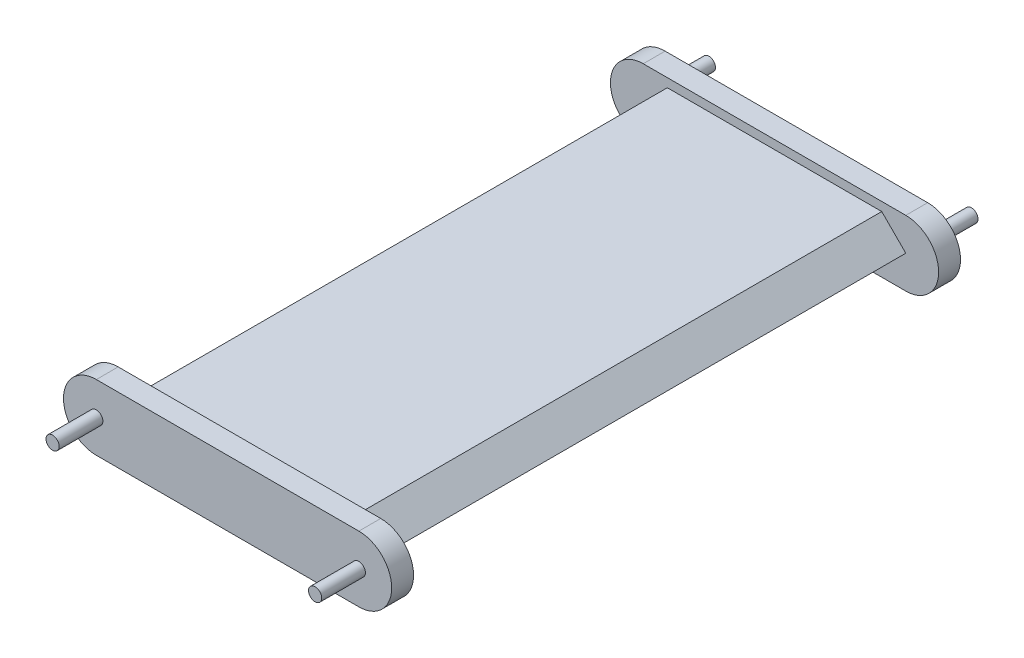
ISO-10303-21;
HEADER;
FILE_DESCRIPTION(('STEP AP214'),'2;1');
FILE_NAME('part.step','',(''),(''),'','','');
FILE_SCHEMA(('AUTOMOTIVE_DESIGN { 1 0 10303 214 1 1 1 1 }'));
ENDSEC;
DATA;
#1=APPLICATION_CONTEXT('core data for automotive mechanical design processes');
#2=APPLICATION_PROTOCOL_DEFINITION('international standard','automotive_design',2000,#1);
#3=PRODUCT_CONTEXT('',#1,'mechanical');
#4=PRODUCT('Part','Part','',(#3));
#5=PRODUCT_RELATED_PRODUCT_CATEGORY('part','',(#4));
#6=PRODUCT_DEFINITION_FORMATION('','',#4);
#7=PRODUCT_DEFINITION_CONTEXT('part definition',#1,'design');
#8=PRODUCT_DEFINITION('design','',#6,#7);
#9=PRODUCT_DEFINITION_SHAPE('','',#8);
#10=(LENGTH_UNIT() NAMED_UNIT(*) SI_UNIT(.MILLI.,.METRE.));
#11=(NAMED_UNIT(*) PLANE_ANGLE_UNIT() SI_UNIT($,.RADIAN.));
#12=(NAMED_UNIT(*) SI_UNIT($,.STERADIAN.) SOLID_ANGLE_UNIT());
#13=UNCERTAINTY_MEASURE_WITH_UNIT(LENGTH_MEASURE(1.E-05),#10,'distance_accuracy_value','');
#14=(GEOMETRIC_REPRESENTATION_CONTEXT(3) GLOBAL_UNCERTAINTY_ASSIGNED_CONTEXT((#13)) GLOBAL_UNIT_ASSIGNED_CONTEXT((#10,
#11,#12)) REPRESENTATION_CONTEXT('',''));
#15=CARTESIAN_POINT('',(0.,0.,0.));
#16=DIRECTION('',(0.,0.,1.));
#17=DIRECTION('',(1.,0.,0.));
#18=AXIS2_PLACEMENT_3D('',#15,#16,#17);
#19=CARTESIAN_POINT('',(76.2,0.,-317.5));
#20=DIRECTION('',(0.,0.,1.));
#21=DIRECTION('',(1.,0.,0.));
#22=AXIS2_PLACEMENT_3D('',#19,#20,#21);
#23=PLANE('',#22);
#24=CARTESIAN_POINT('',(-76.2,0.,-317.5));
#25=DIRECTION('',(0.,0.,1.));
#26=DIRECTION('',(1.,0.,0.));
#27=AXIS2_PLACEMENT_3D('',#24,#25,#26);
#28=CIRCLE('',#27,3.81000000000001);
#29=CARTESIAN_POINT('',(-72.39,0.,-317.5));
#30=VERTEX_POINT('',#29);
#31=EDGE_CURVE('E219',#30,#30,#28,.F.);
#32=ORIENTED_EDGE('',*,*,#31,.F.);
#33=EDGE_LOOP('',(#32));
#34=FACE_BOUND('',#33,.T.);
#35=CARTESIAN_POINT('',(76.2,0.,-317.5));
#36=DIRECTION('',(0.,0.,-1.));
#37=DIRECTION('',(1.,0.,0.));
#38=AXIS2_PLACEMENT_3D('',#35,#36,#37);
#39=CIRCLE('',#38,19.05);
#40=CARTESIAN_POINT('',(76.2,19.05,-317.5));
#41=VERTEX_POINT('',#40);
#42=CARTESIAN_POINT('',(76.2,-19.05,-317.5));
#43=VERTEX_POINT('',#42);
#44=EDGE_CURVE('E147',#41,#43,#39,.T.);
#45=ORIENTED_EDGE('',*,*,#44,.T.);
#46=DIRECTION('',(-1.,0.,0.));
#47=VECTOR('',#46,1.);
#48=CARTESIAN_POINT('',(76.2,-19.05,-317.5));
#49=LINE('',#48,#47);
#50=CARTESIAN_POINT('',(-76.2,-19.05,-317.5));
#51=VERTEX_POINT('',#50);
#52=EDGE_CURVE('E136',#43,#51,#49,.T.);
#53=ORIENTED_EDGE('',*,*,#52,.T.);
#54=CARTESIAN_POINT('',(-76.2,0.,-317.5));
#55=DIRECTION('',(0.,0.,-1.));
#56=DIRECTION('',(1.,0.,0.));
#57=AXIS2_PLACEMENT_3D('',#54,#55,#56);
#58=CIRCLE('',#57,19.05);
#59=CARTESIAN_POINT('',(-76.2,19.05,-317.5));
#60=VERTEX_POINT('',#59);
#61=EDGE_CURVE('E146',#51,#60,#58,.T.);
#62=ORIENTED_EDGE('',*,*,#61,.T.);
#63=DIRECTION('',(1.,0.,0.));
#64=VECTOR('',#63,1.);
#65=CARTESIAN_POINT('',(76.2,19.05,-317.5));
#66=LINE('',#65,#64);
#67=EDGE_CURVE('E152',#60,#41,#66,.T.);
#68=ORIENTED_EDGE('',*,*,#67,.T.);
#69=EDGE_LOOP('',(#45,#53,#62,#68));
#70=FACE_BOUND('',#69,.T.);
#71=CARTESIAN_POINT('',(76.2,0.,-317.5));
#72=DIRECTION('',(0.,0.,1.));
#73=DIRECTION('',(1.,0.,0.));
#74=AXIS2_PLACEMENT_3D('',#71,#72,#73);
#75=CIRCLE('',#74,3.81);
#76=CARTESIAN_POINT('',(80.01,0.,-317.5));
#77=VERTEX_POINT('',#76);
#78=EDGE_CURVE('E222',#77,#77,#75,.F.);
#79=ORIENTED_EDGE('',*,*,#78,.F.);
#80=EDGE_LOOP('',(#79));
#81=FACE_BOUND('',#80,.T.);
#82=ADVANCED_FACE('F34',(#34,#70,#81),#23,.F.);
#83=CARTESIAN_POINT('',(-76.2,0.,0.));
#84=DIRECTION('',(0.,0.,-1.));
#85=DIRECTION('',(-1.,0.,0.));
#86=AXIS2_PLACEMENT_3D('',#83,#84,#85);
#87=PLANE('',#86);
#88=CARTESIAN_POINT('',(-76.2,0.,0.));
#89=DIRECTION('',(0.,0.,1.));
#90=DIRECTION('',(-1.,0.,0.));
#91=AXIS2_PLACEMENT_3D('',#88,#89,#90);
#92=CIRCLE('',#91,19.05);
#93=CARTESIAN_POINT('',(-76.2,19.05,0.));
#94=VERTEX_POINT('',#93);
#95=CARTESIAN_POINT('',(-76.2,-19.05,0.));
#96=VERTEX_POINT('',#95);
#97=EDGE_CURVE('E183',#94,#96,#92,.T.);
#98=ORIENTED_EDGE('',*,*,#97,.F.);
#99=DIRECTION('',(-1.,0.,0.));
#100=VECTOR('',#99,1.);
#101=CARTESIAN_POINT('',(-76.2,19.05,0.));
#102=LINE('',#101,#100);
#103=CARTESIAN_POINT('',(76.2,19.05,0.));
#104=VERTEX_POINT('',#103);
#105=EDGE_CURVE('E188',#104,#94,#102,.T.);
#106=ORIENTED_EDGE('',*,*,#105,.F.);
#107=CARTESIAN_POINT('',(76.2,0.,0.));
#108=DIRECTION('',(0.,0.,1.));
#109=DIRECTION('',(-1.,0.,0.));
#110=AXIS2_PLACEMENT_3D('',#107,#108,#109);
#111=CIRCLE('',#110,19.05);
#112=CARTESIAN_POINT('',(76.2,-19.05,0.));
#113=VERTEX_POINT('',#112);
#114=EDGE_CURVE('E199',#113,#104,#111,.T.);
#115=ORIENTED_EDGE('',*,*,#114,.F.);
#116=DIRECTION('',(1.,0.,0.));
#117=VECTOR('',#116,1.);
#118=CARTESIAN_POINT('',(-76.2,-19.05,0.));
#119=LINE('',#118,#117);
#120=EDGE_CURVE('E197',#96,#113,#119,.T.);
#121=ORIENTED_EDGE('',*,*,#120,.F.);
#122=EDGE_LOOP('',(#98,#106,#115,#121));
#123=FACE_BOUND('',#122,.T.);
#124=DIRECTION('',(0.707106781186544,0.707106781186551,0.));
#125=VECTOR('',#124,1.);
#126=CARTESIAN_POINT('',(-62.2299999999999,13.97,0.));
#127=LINE('',#126,#125);
#128=CARTESIAN_POINT('',(-62.2299999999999,13.97,0.));
#129=VERTEX_POINT('',#128);
#130=CARTESIAN_POINT('',(-76.2,-2.5832923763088E-13,0.));
#131=VERTEX_POINT('',#130);
#132=EDGE_CURVE('E57',#129,#131,#127,.F.);
#133=ORIENTED_EDGE('',*,*,#132,.T.);
#134=DIRECTION('',(-0.707106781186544,0.707106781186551,0.));
#135=VECTOR('',#134,1.);
#136=CARTESIAN_POINT('',(-76.2,2.1163626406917E-13,0.));
#137=LINE('',#136,#135);
#138=CARTESIAN_POINT('',(-62.2299999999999,-13.97,0.));
#139=VERTEX_POINT('',#138);
#140=EDGE_CURVE('E43',#131,#139,#137,.F.);
#141=ORIENTED_EDGE('',*,*,#140,.T.);
#142=DIRECTION('',(-1.,0.,0.));
#143=VECTOR('',#142,1.);
#144=CARTESIAN_POINT('',(-76.2,-13.97,0.));
#145=LINE('',#144,#143);
#146=CARTESIAN_POINT('',(62.2299999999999,-13.9700000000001,0.));
#147=VERTEX_POINT('',#146);
#148=EDGE_CURVE('E164',#147,#139,#145,.T.);
#149=ORIENTED_EDGE('',*,*,#148,.F.);
#150=DIRECTION('',(-0.707106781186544,-0.707106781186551,0.));
#151=VECTOR('',#150,1.);
#152=CARTESIAN_POINT('',(62.2299999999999,-13.9700000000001,0.));
#153=LINE('',#152,#151);
#154=CARTESIAN_POINT('',(76.2,-2.70616862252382E-13,0.));
#155=VERTEX_POINT('',#154);
#156=EDGE_CURVE('E239',#147,#155,#153,.F.);
#157=ORIENTED_EDGE('',*,*,#156,.T.);
#158=DIRECTION('',(0.707106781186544,-0.707106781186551,0.));
#159=VECTOR('',#158,1.);
#160=CARTESIAN_POINT('',(76.2,-2.70616862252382E-13,0.));
#161=LINE('',#160,#159);
#162=CARTESIAN_POINT('',(62.2299999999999,13.97,0.));
#163=VERTEX_POINT('',#162);
#164=EDGE_CURVE('E235',#155,#163,#161,.F.);
#165=ORIENTED_EDGE('',*,*,#164,.T.);
#166=DIRECTION('',(1.,0.,0.));
#167=VECTOR('',#166,1.);
#168=CARTESIAN_POINT('',(-76.2,13.97,0.));
#169=LINE('',#168,#167);
#170=EDGE_CURVE('E161',#129,#163,#169,.T.);
#171=ORIENTED_EDGE('',*,*,#170,.F.);
#172=EDGE_LOOP('',(#133,#141,#149,#157,#165,#171));
#173=FACE_BOUND('',#172,.T.);
#174=ADVANCED_FACE('F263',(#123,#173),#87,.T.);
#175=CARTESIAN_POINT('',(-76.2,0.,12.7));
#176=DIRECTION('',(0.,0.,-1.));
#177=DIRECTION('',(-1.,0.,0.));
#178=AXIS2_PLACEMENT_3D('',#175,#176,#177);
#179=PLANE('',#178);
#180=CARTESIAN_POINT('',(76.2,0.,12.7));
#181=DIRECTION('',(0.,0.,-1.));
#182=DIRECTION('',(-1.,0.,0.));
#183=AXIS2_PLACEMENT_3D('',#180,#181,#182);
#184=CIRCLE('',#183,3.81);
#185=CARTESIAN_POINT('',(72.39,0.,12.7));
#186=VERTEX_POINT('',#185);
#187=EDGE_CURVE('E213',#186,#186,#184,.F.);
#188=ORIENTED_EDGE('',*,*,#187,.F.);
#189=EDGE_LOOP('',(#188));
#190=FACE_BOUND('',#189,.T.);
#191=CARTESIAN_POINT('',(-76.2,0.,12.7));
#192=DIRECTION('',(0.,0.,1.));
#193=DIRECTION('',(-1.,0.,0.));
#194=AXIS2_PLACEMENT_3D('',#191,#192,#193);
#195=CIRCLE('',#194,19.05);
#196=CARTESIAN_POINT('',(-76.2,19.05,12.7));
#197=VERTEX_POINT('',#196);
#198=CARTESIAN_POINT('',(-76.2,-19.05,12.7));
#199=VERTEX_POINT('',#198);
#200=EDGE_CURVE('E184',#197,#199,#195,.T.);
#201=ORIENTED_EDGE('',*,*,#200,.T.);
#202=DIRECTION('',(1.,0.,0.));
#203=VECTOR('',#202,1.);
#204=CARTESIAN_POINT('',(-76.2,-19.05,12.7));
#205=LINE('',#204,#203);
#206=CARTESIAN_POINT('',(76.2,-19.05,12.7));
#207=VERTEX_POINT('',#206);
#208=EDGE_CURVE('E187',#199,#207,#205,.T.);
#209=ORIENTED_EDGE('',*,*,#208,.T.);
#210=CARTESIAN_POINT('',(76.2,0.,12.7));
#211=DIRECTION('',(0.,0.,1.));
#212=DIRECTION('',(-1.,0.,0.));
#213=AXIS2_PLACEMENT_3D('',#210,#211,#212);
#214=CIRCLE('',#213,19.05);
#215=CARTESIAN_POINT('',(76.2,19.05,12.7));
#216=VERTEX_POINT('',#215);
#217=EDGE_CURVE('E190',#207,#216,#214,.T.);
#218=ORIENTED_EDGE('',*,*,#217,.T.);
#219=DIRECTION('',(-1.,0.,0.));
#220=VECTOR('',#219,1.);
#221=CARTESIAN_POINT('',(-76.2,19.05,12.7));
#222=LINE('',#221,#220);
#223=EDGE_CURVE('E192',#216,#197,#222,.T.);
#224=ORIENTED_EDGE('',*,*,#223,.T.);
#225=EDGE_LOOP('',(#201,#209,#218,#224));
#226=FACE_BOUND('',#225,.T.);
#227=CARTESIAN_POINT('',(-76.2,0.,12.7));
#228=DIRECTION('',(0.,0.,-1.));
#229=DIRECTION('',(-1.,0.,0.));
#230=AXIS2_PLACEMENT_3D('',#227,#228,#229);
#231=CIRCLE('',#230,3.81);
#232=CARTESIAN_POINT('',(-80.01,0.,12.7));
#233=VERTEX_POINT('',#232);
#234=EDGE_CURVE('E216',#233,#233,#231,.F.);
#235=ORIENTED_EDGE('',*,*,#234,.F.);
#236=EDGE_LOOP('',(#235));
#237=FACE_BOUND('',#236,.T.);
#238=ADVANCED_FACE('F294',(#190,#226,#237),#179,.F.);
#239=CARTESIAN_POINT('',(-76.2,0.,12.7));
#240=DIRECTION('',(0.,0.,-1.));
#241=DIRECTION('',(-1.,0.,0.));
#242=AXIS2_PLACEMENT_3D('',#239,#240,#241);
#243=CYLINDRICAL_SURFACE('',#242,19.05);
#244=ORIENTED_EDGE('',*,*,#97,.T.);
#245=DIRECTION('',(0.,0.,-1.));
#246=VECTOR('',#245,1.);
#247=CARTESIAN_POINT('',(-76.2,-19.05,12.7));
#248=LINE('',#247,#246);
#249=EDGE_CURVE('E210',#199,#96,#248,.T.);
#250=ORIENTED_EDGE('',*,*,#249,.F.);
#251=ORIENTED_EDGE('',*,*,#200,.F.);
#252=DIRECTION('',(0.,0.,-1.));
#253=VECTOR('',#252,1.);
#254=CARTESIAN_POINT('',(-76.2,19.05,12.7));
#255=LINE('',#254,#253);
#256=EDGE_CURVE('E194',#197,#94,#255,.T.);
#257=ORIENTED_EDGE('',*,*,#256,.T.);
#258=EDGE_LOOP('',(#244,#250,#251,#257));
#259=FACE_BOUND('',#258,.T.);
#260=ADVANCED_FACE('F474',(#259),#243,.T.);
#261=CARTESIAN_POINT('',(-76.2,-19.05,12.7));
#262=DIRECTION('',(0.,1.,0.));
#263=DIRECTION('',(-1.,0.,0.));
#264=AXIS2_PLACEMENT_3D('',#261,#262,#263);
#265=PLANE('',#264);
#266=ORIENTED_EDGE('',*,*,#120,.T.);
#267=DIRECTION('',(0.,0.,-1.));
#268=VECTOR('',#267,1.);
#269=CARTESIAN_POINT('',(76.2,-19.05,12.7));
#270=LINE('',#269,#268);
#271=EDGE_CURVE('E207',#207,#113,#270,.T.);
#272=ORIENTED_EDGE('',*,*,#271,.F.);
#273=ORIENTED_EDGE('',*,*,#208,.F.);
#274=ORIENTED_EDGE('',*,*,#249,.T.);
#275=EDGE_LOOP('',(#266,#272,#273,#274));
#276=FACE_BOUND('',#275,.T.);
#277=ADVANCED_FACE('F494',(#276),#265,.F.);
#278=CARTESIAN_POINT('',(76.2,0.,12.7));
#279=DIRECTION('',(0.,0.,-1.));
#280=DIRECTION('',(-1.,0.,0.));
#281=AXIS2_PLACEMENT_3D('',#278,#279,#280);
#282=CYLINDRICAL_SURFACE('',#281,19.05);
#283=ORIENTED_EDGE('',*,*,#114,.T.);
#284=DIRECTION('',(0.,0.,-1.));
#285=VECTOR('',#284,1.);
#286=CARTESIAN_POINT('',(76.2,19.05,12.7));
#287=LINE('',#286,#285);
#288=EDGE_CURVE('E204',#216,#104,#287,.T.);
#289=ORIENTED_EDGE('',*,*,#288,.F.);
#290=ORIENTED_EDGE('',*,*,#217,.F.);
#291=ORIENTED_EDGE('',*,*,#271,.T.);
#292=EDGE_LOOP('',(#283,#289,#290,#291));
#293=FACE_BOUND('',#292,.T.);
#294=ADVANCED_FACE('F484',(#293),#282,.T.);
#295=CARTESIAN_POINT('',(-76.2,19.05,12.7));
#296=DIRECTION('',(0.,-1.,0.));
#297=DIRECTION('',(0.,0.,-1.));
#298=AXIS2_PLACEMENT_3D('',#295,#296,#297);
#299=PLANE('',#298);
#300=ORIENTED_EDGE('',*,*,#105,.T.);
#301=ORIENTED_EDGE('',*,*,#256,.F.);
#302=ORIENTED_EDGE('',*,*,#223,.F.);
#303=ORIENTED_EDGE('',*,*,#288,.T.);
#304=EDGE_LOOP('',(#300,#301,#302,#303));
#305=FACE_BOUND('',#304,.T.);
#306=ADVANCED_FACE('F464',(#305),#299,.F.);
#307=CARTESIAN_POINT('',(76.2,0.,38.1));
#308=DIRECTION('',(0.,0.,-1.));
#309=DIRECTION('',(-1.,0.,0.));
#310=AXIS2_PLACEMENT_3D('',#307,#308,#309);
#311=CYLINDRICAL_SURFACE('',#310,3.81);
#312=CARTESIAN_POINT('',(76.2,0.,38.1));
#313=DIRECTION('',(0.,0.,1.));
#314=DIRECTION('',(1.,0.,0.));
#315=AXIS2_PLACEMENT_3D('',#312,#313,#314);
#316=CIRCLE('',#315,3.81);
#317=CARTESIAN_POINT('',(80.01,0.,38.1));
#318=VERTEX_POINT('',#317);
#319=EDGE_CURVE('E180',#318,#318,#316,.T.);
#320=ORIENTED_EDGE('',*,*,#319,.F.);
#321=EDGE_LOOP('',(#320));
#322=FACE_BOUND('',#321,.T.);
#323=ORIENTED_EDGE('',*,*,#187,.T.);
#324=EDGE_LOOP('',(#323));
#325=FACE_BOUND('',#324,.T.);
#326=ADVANCED_FACE('F454',(#322,#325),#311,.T.);
#327=CARTESIAN_POINT('',(76.2,0.,38.1));
#328=DIRECTION('',(0.,0.,1.));
#329=DIRECTION('',(1.,0.,0.));
#330=AXIS2_PLACEMENT_3D('',#327,#328,#329);
#331=PLANE('',#330);
#332=ORIENTED_EDGE('',*,*,#319,.T.);
#333=EDGE_LOOP('',(#332));
#334=FACE_BOUND('',#333,.T.);
#335=ADVANCED_FACE('F444',(#334),#331,.T.);
#336=CARTESIAN_POINT('',(-76.2,0.,38.1));
#337=DIRECTION('',(0.,0.,-1.));
#338=DIRECTION('',(-1.,0.,0.));
#339=AXIS2_PLACEMENT_3D('',#336,#337,#338);
#340=CYLINDRICAL_SURFACE('',#339,3.81);
#341=CARTESIAN_POINT('',(-76.2,0.,38.1));
#342=DIRECTION('',(0.,0.,1.));
#343=DIRECTION('',(1.,0.,0.));
#344=AXIS2_PLACEMENT_3D('',#341,#342,#343);
#345=CIRCLE('',#344,3.81);
#346=CARTESIAN_POINT('',(-72.39,0.,38.1));
#347=VERTEX_POINT('',#346);
#348=EDGE_CURVE('E174',#347,#347,#345,.T.);
#349=ORIENTED_EDGE('',*,*,#348,.F.);
#350=EDGE_LOOP('',(#349));
#351=FACE_BOUND('',#350,.T.);
#352=ORIENTED_EDGE('',*,*,#234,.T.);
#353=EDGE_LOOP('',(#352));
#354=FACE_BOUND('',#353,.T.);
#355=ADVANCED_FACE('F434',(#351,#354),#340,.T.);
#356=CARTESIAN_POINT('',(-76.2,0.,38.1));
#357=DIRECTION('',(0.,0.,1.));
#358=DIRECTION('',(1.,0.,0.));
#359=AXIS2_PLACEMENT_3D('',#356,#357,#358);
#360=PLANE('',#359);
#361=ORIENTED_EDGE('',*,*,#348,.T.);
#362=EDGE_LOOP('',(#361));
#363=FACE_BOUND('',#362,.T.);
#364=ADVANCED_FACE('F362',(#363),#360,.T.);
#365=CARTESIAN_POINT('',(-76.2,13.97,-304.8));
#366=DIRECTION('',(0.,-1.,0.));
#367=DIRECTION('',(1.,0.,0.));
#368=AXIS2_PLACEMENT_3D('',#365,#366,#367);
#369=PLANE('',#368);
#370=ORIENTED_EDGE('',*,*,#170,.T.);
#371=DIRECTION('',(0.,0.,-1.));
#372=VECTOR('',#371,1.);
#373=CARTESIAN_POINT('',(62.2299999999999,13.97,-304.8));
#374=LINE('',#373,#372);
#375=CARTESIAN_POINT('',(62.2299999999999,13.97,-304.8));
#376=VERTEX_POINT('',#375);
#377=EDGE_CURVE('E228',#163,#376,#374,.T.);
#378=ORIENTED_EDGE('',*,*,#377,.T.);
#379=DIRECTION('',(1.,0.,0.));
#380=VECTOR('',#379,1.);
#381=CARTESIAN_POINT('',(-76.2,13.97,-304.8));
#382=LINE('',#381,#380);
#383=CARTESIAN_POINT('',(-62.2299999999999,13.97,-304.8));
#384=VERTEX_POINT('',#383);
#385=EDGE_CURVE('E170',#384,#376,#382,.T.);
#386=ORIENTED_EDGE('',*,*,#385,.F.);
#387=DIRECTION('',(0.,0.,1.));
#388=VECTOR('',#387,1.);
#389=CARTESIAN_POINT('',(-62.2299999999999,13.97,-304.8));
#390=LINE('',#389,#388);
#391=EDGE_CURVE('E225',#384,#129,#390,.T.);
#392=ORIENTED_EDGE('',*,*,#391,.T.);
#393=EDGE_LOOP('',(#370,#378,#386,#392));
#394=FACE_BOUND('',#393,.T.);
#395=ADVANCED_FACE('F274',(#394),#369,.F.);
#396=CARTESIAN_POINT('',(-76.2,-13.97,-304.8));
#397=DIRECTION('',(0.,1.,0.));
#398=DIRECTION('',(-1.,0.,0.));
#399=AXIS2_PLACEMENT_3D('',#396,#397,#398);
#400=PLANE('',#399);
#401=DIRECTION('',(-1.,0.,0.));
#402=VECTOR('',#401,1.);
#403=CARTESIAN_POINT('',(-76.2,-13.97,-304.8));
#404=LINE('',#403,#402);
#405=CARTESIAN_POINT('',(62.2299999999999,-13.9700000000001,-304.8));
#406=VERTEX_POINT('',#405);
#407=CARTESIAN_POINT('',(-62.2299999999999,-13.97,-304.8));
#408=VERTEX_POINT('',#407);
#409=EDGE_CURVE('E173',#406,#408,#404,.T.);
#410=ORIENTED_EDGE('',*,*,#409,.F.);
#411=DIRECTION('',(0.,0.,1.));
#412=VECTOR('',#411,1.);
#413=CARTESIAN_POINT('',(62.2299999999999,-13.9700000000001,-304.8));
#414=LINE('',#413,#412);
#415=EDGE_CURVE('E233',#406,#147,#414,.T.);
#416=ORIENTED_EDGE('',*,*,#415,.T.);
#417=ORIENTED_EDGE('',*,*,#148,.T.);
#418=DIRECTION('',(0.,0.,-1.));
#419=VECTOR('',#418,1.);
#420=CARTESIAN_POINT('',(-62.2299999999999,-13.97,-304.8));
#421=LINE('',#420,#419);
#422=EDGE_CURVE('E231',#139,#408,#421,.T.);
#423=ORIENTED_EDGE('',*,*,#422,.T.);
#424=EDGE_LOOP('',(#410,#416,#417,#423));
#425=FACE_BOUND('',#424,.T.);
#426=ADVANCED_FACE('F267',(#425),#400,.F.);
#427=CARTESIAN_POINT('',(76.2,0.,-304.8));
#428=DIRECTION('',(0.,0.,1.));
#429=DIRECTION('',(1.,0.,0.));
#430=AXIS2_PLACEMENT_3D('',#427,#428,#429);
#431=PLANE('',#430);
#432=CARTESIAN_POINT('',(76.2,0.,-304.8));
#433=DIRECTION('',(0.,0.,-1.));
#434=DIRECTION('',(1.,0.,0.));
#435=AXIS2_PLACEMENT_3D('',#432,#433,#434);
#436=CIRCLE('',#435,19.05);
#437=CARTESIAN_POINT('',(76.2,19.05,-304.8));
#438=VERTEX_POINT('',#437);
#439=CARTESIAN_POINT('',(76.2,-19.05,-304.8));
#440=VERTEX_POINT('',#439);
#441=EDGE_CURVE('E160',#438,#440,#436,.T.);
#442=ORIENTED_EDGE('',*,*,#441,.F.);
#443=DIRECTION('',(1.,0.,0.));
#444=VECTOR('',#443,1.);
#445=CARTESIAN_POINT('',(76.2,19.05,-304.8));
#446=LINE('',#445,#444);
#447=CARTESIAN_POINT('',(-76.2,19.05,-304.8));
#448=VERTEX_POINT('',#447);
#449=EDGE_CURVE('E156',#448,#438,#446,.T.);
#450=ORIENTED_EDGE('',*,*,#449,.F.);
#451=CARTESIAN_POINT('',(-76.2,0.,-304.8));
#452=DIRECTION('',(0.,0.,-1.));
#453=DIRECTION('',(1.,0.,0.));
#454=AXIS2_PLACEMENT_3D('',#451,#452,#453);
#455=CIRCLE('',#454,19.05);
#456=CARTESIAN_POINT('',(-76.2,-19.05,-304.8));
#457=VERTEX_POINT('',#456);
#458=EDGE_CURVE('E535',#457,#448,#455,.T.);
#459=ORIENTED_EDGE('',*,*,#458,.F.);
#460=DIRECTION('',(-1.,0.,0.));
#461=VECTOR('',#460,1.);
#462=CARTESIAN_POINT('',(76.2,-19.05,-304.8));
#463=LINE('',#462,#461);
#464=EDGE_CURVE('E538',#440,#457,#463,.T.);
#465=ORIENTED_EDGE('',*,*,#464,.F.);
#466=EDGE_LOOP('',(#442,#450,#459,#465));
#467=FACE_BOUND('',#466,.T.);
#468=ORIENTED_EDGE('',*,*,#409,.T.);
#469=DIRECTION('',(0.707106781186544,-0.707106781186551,0.));
#470=VECTOR('',#469,1.);
#471=CARTESIAN_POINT('',(-76.2,2.1163626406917E-13,-304.8));
#472=LINE('',#471,#470);
#473=CARTESIAN_POINT('',(-76.2,-2.5832923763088E-13,-304.8));
#474=VERTEX_POINT('',#473);
#475=EDGE_CURVE('E11',#408,#474,#472,.F.);
#476=ORIENTED_EDGE('',*,*,#475,.T.);
#477=DIRECTION('',(-0.707106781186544,-0.707106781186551,0.));
#478=VECTOR('',#477,1.);
#479=CARTESIAN_POINT('',(-62.2299999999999,13.97,-304.8));
#480=LINE('',#479,#478);
#481=EDGE_CURVE('E244',#474,#384,#480,.F.);
#482=ORIENTED_EDGE('',*,*,#481,.T.);
#483=ORIENTED_EDGE('',*,*,#385,.T.);
#484=DIRECTION('',(-0.707106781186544,0.707106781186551,0.));
#485=VECTOR('',#484,1.);
#486=CARTESIAN_POINT('',(76.2,-2.70616862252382E-13,-304.8));
#487=LINE('',#486,#485);
#488=CARTESIAN_POINT('',(76.2,-2.70616862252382E-13,-304.8));
#489=VERTEX_POINT('',#488);
#490=EDGE_CURVE('E237',#376,#489,#487,.F.);
#491=ORIENTED_EDGE('',*,*,#490,.T.);
#492=DIRECTION('',(0.707106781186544,0.707106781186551,0.));
#493=VECTOR('',#492,1.);
#494=CARTESIAN_POINT('',(62.2299999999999,-13.9700000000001,-304.8));
#495=LINE('',#494,#493);
#496=EDGE_CURVE('E241',#489,#406,#495,.F.);
#497=ORIENTED_EDGE('',*,*,#496,.T.);
#498=EDGE_LOOP('',(#468,#476,#482,#483,#491,#497));
#499=FACE_BOUND('',#498,.T.);
#500=ADVANCED_FACE('F277',(#467,#499),#431,.T.);
#501=CARTESIAN_POINT('',(76.2,0.,-317.5));
#502=DIRECTION('',(0.,0.,1.));
#503=DIRECTION('',(1.,0.,0.));
#504=AXIS2_PLACEMENT_3D('',#501,#502,#503);
#505=CYLINDRICAL_SURFACE('',#504,19.05);
#506=ORIENTED_EDGE('',*,*,#441,.T.);
#507=DIRECTION('',(0.,0.,1.));
#508=VECTOR('',#507,1.);
#509=CARTESIAN_POINT('',(76.2,-19.05,-317.5));
#510=LINE('',#509,#508);
#511=EDGE_CURVE('E140',#43,#440,#510,.T.);
#512=ORIENTED_EDGE('',*,*,#511,.F.);
#513=ORIENTED_EDGE('',*,*,#44,.F.);
#514=DIRECTION('',(0.,0.,1.));
#515=VECTOR('',#514,1.);
#516=CARTESIAN_POINT('',(76.2,19.05,-317.5));
#517=LINE('',#516,#515);
#518=EDGE_CURVE('E540',#41,#438,#517,.T.);
#519=ORIENTED_EDGE('',*,*,#518,.T.);
#520=EDGE_LOOP('',(#506,#512,#513,#519));
#521=FACE_BOUND('',#520,.T.);
#522=ADVANCED_FACE('F158',(#521),#505,.T.);
#523=CARTESIAN_POINT('',(76.2,-19.05,-317.5));
#524=DIRECTION('',(0.,1.,0.));
#525=DIRECTION('',(0.,0.,1.));
#526=AXIS2_PLACEMENT_3D('',#523,#524,#525);
#527=PLANE('',#526);
#528=ORIENTED_EDGE('',*,*,#464,.T.);
#529=DIRECTION('',(0.,0.,1.));
#530=VECTOR('',#529,1.);
#531=CARTESIAN_POINT('',(-76.2,-19.05,-317.5));
#532=LINE('',#531,#530);
#533=EDGE_CURVE('E143',#51,#457,#532,.T.);
#534=ORIENTED_EDGE('',*,*,#533,.F.);
#535=ORIENTED_EDGE('',*,*,#52,.F.);
#536=ORIENTED_EDGE('',*,*,#511,.T.);
#537=EDGE_LOOP('',(#528,#534,#535,#536));
#538=FACE_BOUND('',#537,.T.);
#539=ADVANCED_FACE('F138',(#538),#527,.F.);
#540=CARTESIAN_POINT('',(-76.2,0.,-317.5));
#541=DIRECTION('',(0.,0.,1.));
#542=DIRECTION('',(1.,0.,0.));
#543=AXIS2_PLACEMENT_3D('',#540,#541,#542);
#544=CYLINDRICAL_SURFACE('',#543,19.05);
#545=ORIENTED_EDGE('',*,*,#458,.T.);
#546=DIRECTION('',(0.,0.,1.));
#547=VECTOR('',#546,1.);
#548=CARTESIAN_POINT('',(-76.2,19.05,-317.5));
#549=LINE('',#548,#547);
#550=EDGE_CURVE('E166',#60,#448,#549,.T.);
#551=ORIENTED_EDGE('',*,*,#550,.F.);
#552=ORIENTED_EDGE('',*,*,#61,.F.);
#553=ORIENTED_EDGE('',*,*,#533,.T.);
#554=EDGE_LOOP('',(#545,#551,#552,#553));
#555=FACE_BOUND('',#554,.T.);
#556=ADVANCED_FACE('F405',(#555),#544,.T.);
#557=CARTESIAN_POINT('',(76.2,19.05,-317.5));
#558=DIRECTION('',(0.,-1.,0.));
#559=DIRECTION('',(0.,0.,-1.));
#560=AXIS2_PLACEMENT_3D('',#557,#558,#559);
#561=PLANE('',#560);
#562=ORIENTED_EDGE('',*,*,#449,.T.);
#563=ORIENTED_EDGE('',*,*,#518,.F.);
#564=ORIENTED_EDGE('',*,*,#67,.F.);
#565=ORIENTED_EDGE('',*,*,#550,.T.);
#566=EDGE_LOOP('',(#562,#563,#564,#565));
#567=FACE_BOUND('',#566,.T.);
#568=ADVANCED_FACE('F303',(#567),#561,.F.);
#569=CARTESIAN_POINT('',(-76.2,0.,-342.899999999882));
#570=DIRECTION('',(0.,0.,1.));
#571=DIRECTION('',(1.,0.,0.));
#572=AXIS2_PLACEMENT_3D('',#569,#570,#571);
#573=CYLINDRICAL_SURFACE('',#572,3.81000000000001);
#574=CARTESIAN_POINT('',(-76.2,0.,-342.899999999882));
#575=DIRECTION('',(0.,0.,-1.));
#576=DIRECTION('',(-1.,0.,0.));
#577=AXIS2_PLACEMENT_3D('',#574,#575,#576);
#578=CIRCLE('',#577,3.81000000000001);
#579=CARTESIAN_POINT('',(-80.01,0.,-342.899999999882));
#580=VERTEX_POINT('',#579);
#581=EDGE_CURVE('E253',#580,#580,#578,.T.);
#582=ORIENTED_EDGE('',*,*,#581,.F.);
#583=EDGE_LOOP('',(#582));
#584=FACE_BOUND('',#583,.T.);
#585=ORIENTED_EDGE('',*,*,#31,.T.);
#586=EDGE_LOOP('',(#585));
#587=FACE_BOUND('',#586,.T.);
#588=ADVANCED_FACE('F299',(#584,#587),#573,.T.);
#589=CARTESIAN_POINT('',(-76.2,0.,-342.899999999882));
#590=DIRECTION('',(0.,0.,-1.));
#591=DIRECTION('',(-1.,0.,0.));
#592=AXIS2_PLACEMENT_3D('',#589,#590,#591);
#593=PLANE('',#592);
#594=ORIENTED_EDGE('',*,*,#581,.T.);
#595=EDGE_LOOP('',(#594));
#596=FACE_BOUND('',#595,.T.);
#597=ADVANCED_FACE('F302',(#596),#593,.T.);
#598=CARTESIAN_POINT('',(76.2,0.,-342.899999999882));
#599=DIRECTION('',(0.,0.,1.));
#600=DIRECTION('',(1.,0.,0.));
#601=AXIS2_PLACEMENT_3D('',#598,#599,#600);
#602=CYLINDRICAL_SURFACE('',#601,3.81);
#603=CARTESIAN_POINT('',(76.2,0.,-342.899999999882));
#604=DIRECTION('',(0.,0.,-1.));
#605=DIRECTION('',(-1.,0.,0.));
#606=AXIS2_PLACEMENT_3D('',#603,#604,#605);
#607=CIRCLE('',#606,3.81);
#608=CARTESIAN_POINT('',(72.39,0.,-342.899999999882));
#609=VERTEX_POINT('',#608);
#610=EDGE_CURVE('E248',#609,#609,#607,.T.);
#611=ORIENTED_EDGE('',*,*,#610,.F.);
#612=EDGE_LOOP('',(#611));
#613=FACE_BOUND('',#612,.T.);
#614=ORIENTED_EDGE('',*,*,#78,.T.);
#615=EDGE_LOOP('',(#614));
#616=FACE_BOUND('',#615,.T.);
#617=ADVANCED_FACE('F307',(#613,#616),#602,.T.);
#618=CARTESIAN_POINT('',(76.2,0.,-342.899999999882));
#619=DIRECTION('',(0.,0.,-1.));
#620=DIRECTION('',(-1.,0.,0.));
#621=AXIS2_PLACEMENT_3D('',#618,#619,#620);
#622=PLANE('',#621);
#623=ORIENTED_EDGE('',*,*,#610,.T.);
#624=EDGE_LOOP('',(#623));
#625=FACE_BOUND('',#624,.T.);
#626=ADVANCED_FACE('F311',(#625),#622,.T.);
#627=CARTESIAN_POINT('',(62.2299999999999,-13.9700000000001,-304.8));
#628=DIRECTION('',(-0.707106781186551,0.707106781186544,0.));
#629=DIRECTION('',(-0.707106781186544,-0.707106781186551,0.));
#630=AXIS2_PLACEMENT_3D('',#627,#628,#629);
#631=PLANE('',#630);
#632=ORIENTED_EDGE('',*,*,#415,.F.);
#633=ORIENTED_EDGE('',*,*,#496,.F.);
#634=DIRECTION('',(0.,0.,-1.));
#635=VECTOR('',#634,1.);
#636=CARTESIAN_POINT('',(76.2,1.96023752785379E-13,-304.8));
#637=LINE('',#636,#635);
#638=EDGE_CURVE('E246',#155,#489,#637,.T.);
#639=ORIENTED_EDGE('',*,*,#638,.F.);
#640=ORIENTED_EDGE('',*,*,#156,.F.);
#641=EDGE_LOOP('',(#632,#633,#639,#640));
#642=FACE_BOUND('',#641,.T.);
#643=ADVANCED_FACE('F271',(#642),#631,.F.);
#644=CARTESIAN_POINT('',(76.2,-2.70616862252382E-13,-304.8));
#645=DIRECTION('',(-0.707106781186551,-0.707106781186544,0.));
#646=DIRECTION('',(0.707106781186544,-0.707106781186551,0.));
#647=AXIS2_PLACEMENT_3D('',#644,#645,#646);
#648=PLANE('',#647);
#649=ORIENTED_EDGE('',*,*,#490,.F.);
#650=ORIENTED_EDGE('',*,*,#377,.F.);
#651=ORIENTED_EDGE('',*,*,#164,.F.);
#652=ORIENTED_EDGE('',*,*,#638,.T.);
#653=EDGE_LOOP('',(#649,#650,#651,#652));
#654=FACE_BOUND('',#653,.T.);
#655=ADVANCED_FACE('F276',(#654),#648,.F.);
#656=CARTESIAN_POINT('',(-76.2,2.1163626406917E-13,-304.8));
#657=DIRECTION('',(0.707106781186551,0.707106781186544,0.));
#658=DIRECTION('',(-0.707106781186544,0.707106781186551,0.));
#659=AXIS2_PLACEMENT_3D('',#656,#657,#658);
#660=PLANE('',#659);
#661=DIRECTION('',(0.,0.,1.));
#662=VECTOR('',#661,1.);
#663=CARTESIAN_POINT('',(-76.2,2.1163626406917E-13,-304.8));
#664=LINE('',#663,#662);
#665=EDGE_CURVE('E38',#474,#131,#664,.T.);
#666=ORIENTED_EDGE('',*,*,#665,.F.);
#667=ORIENTED_EDGE('',*,*,#475,.F.);
#668=ORIENTED_EDGE('',*,*,#422,.F.);
#669=ORIENTED_EDGE('',*,*,#140,.F.);
#670=EDGE_LOOP('',(#666,#667,#668,#669));
#671=FACE_BOUND('',#670,.T.);
#672=ADVANCED_FACE('F36',(#671),#660,.F.);
#673=CARTESIAN_POINT('',(-62.2299999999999,13.97,-304.8));
#674=DIRECTION('',(0.707106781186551,-0.707106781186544,0.));
#675=DIRECTION('',(0.707106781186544,0.707106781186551,0.));
#676=AXIS2_PLACEMENT_3D('',#673,#674,#675);
#677=PLANE('',#676);
#678=ORIENTED_EDGE('',*,*,#481,.F.);
#679=ORIENTED_EDGE('',*,*,#665,.T.);
#680=ORIENTED_EDGE('',*,*,#132,.F.);
#681=ORIENTED_EDGE('',*,*,#391,.F.);
#682=EDGE_LOOP('',(#678,#679,#680,#681));
#683=FACE_BOUND('',#682,.T.);
#684=ADVANCED_FACE('F258',(#683),#677,.F.);
#685=CLOSED_SHELL('',(#82,#174,#238,#260,#277,#294,#306,#326,#335,#355,#364,#395,#426,#500,#522,
#539,#556,#568,#588,#597,#617,#626,#643,#655,#672,#684));
#686=MANIFOLD_SOLID_BREP('B2',#685);
#687=ADVANCED_BREP_SHAPE_REPRESENTATION('',(#18,#686),#14);
#688=SHAPE_DEFINITION_REPRESENTATION(#9,#687);
ENDSEC;
END-ISO-10303-21;
